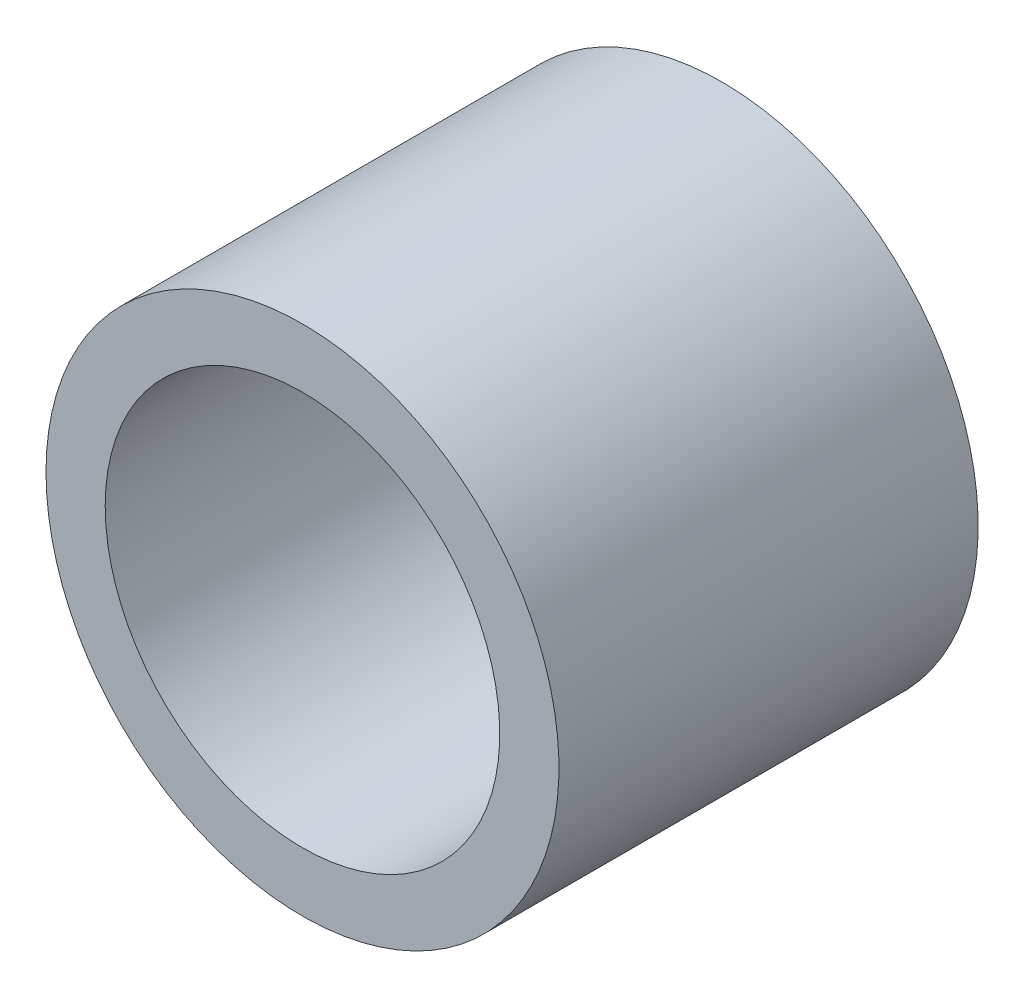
ISO-10303-21;
HEADER;
FILE_DESCRIPTION(('STEP AP214'),'2;1');
FILE_NAME('part.step','',(''),(''),'','','');
FILE_SCHEMA(('AUTOMOTIVE_DESIGN { 1 0 10303 214 1 1 1 1 }'));
ENDSEC;
DATA;
#1=APPLICATION_CONTEXT('core data for automotive mechanical design processes');
#2=APPLICATION_PROTOCOL_DEFINITION('international standard','automotive_design',2000,#1);
#3=PRODUCT_CONTEXT('',#1,'mechanical');
#4=PRODUCT('Part','Part','',(#3));
#5=PRODUCT_RELATED_PRODUCT_CATEGORY('part','',(#4));
#6=PRODUCT_DEFINITION_FORMATION('','',#4);
#7=PRODUCT_DEFINITION_CONTEXT('part definition',#1,'design');
#8=PRODUCT_DEFINITION('design','',#6,#7);
#9=PRODUCT_DEFINITION_SHAPE('','',#8);
#10=(LENGTH_UNIT() NAMED_UNIT(*) SI_UNIT(.MILLI.,.METRE.));
#11=(NAMED_UNIT(*) PLANE_ANGLE_UNIT() SI_UNIT($,.RADIAN.));
#12=(NAMED_UNIT(*) SI_UNIT($,.STERADIAN.) SOLID_ANGLE_UNIT());
#13=UNCERTAINTY_MEASURE_WITH_UNIT(LENGTH_MEASURE(1.E-05),#10,'distance_accuracy_value','');
#14=(GEOMETRIC_REPRESENTATION_CONTEXT(3) GLOBAL_UNCERTAINTY_ASSIGNED_CONTEXT((#13)) GLOBAL_UNIT_ASSIGNED_CONTEXT((#10,
#11,#12)) REPRESENTATION_CONTEXT('',''));
#15=CARTESIAN_POINT('',(0.,0.,0.));
#16=DIRECTION('',(0.,0.,1.));
#17=DIRECTION('',(1.,0.,0.));
#18=AXIS2_PLACEMENT_3D('',#15,#16,#17);
#19=CARTESIAN_POINT('',(0.,0.,21.59));
#20=DIRECTION('',(0.,0.,-1.));
#21=DIRECTION('',(-1.,0.,0.));
#22=AXIS2_PLACEMENT_3D('',#19,#20,#21);
#23=CYLINDRICAL_SURFACE('',#22,10.16);
#24=CARTESIAN_POINT('',(0.,0.,0.));
#25=DIRECTION('',(0.,0.,-1.));
#26=DIRECTION('',(-1.,0.,0.));
#27=AXIS2_PLACEMENT_3D('',#24,#25,#26);
#28=CIRCLE('',#27,10.16);
#29=CARTESIAN_POINT('',(-10.16,0.,0.));
#30=VERTEX_POINT('',#29);
#31=EDGE_CURVE('E24',#30,#30,#28,.T.);
#32=ORIENTED_EDGE('',*,*,#31,.T.);
#33=EDGE_LOOP('',(#32));
#34=FACE_BOUND('',#33,.T.);
#35=CARTESIAN_POINT('',(0.,0.,21.59));
#36=DIRECTION('',(0.,0.,-1.));
#37=DIRECTION('',(-1.,0.,0.));
#38=AXIS2_PLACEMENT_3D('',#35,#36,#37);
#39=CIRCLE('',#38,10.16);
#40=CARTESIAN_POINT('',(-10.16,0.,21.59));
#41=VERTEX_POINT('',#40);
#42=EDGE_CURVE('E15',#41,#41,#39,.T.);
#43=ORIENTED_EDGE('',*,*,#42,.F.);
#44=EDGE_LOOP('',(#43));
#45=FACE_BOUND('',#44,.T.);
#46=ADVANCED_FACE('F12',(#34,#45),#23,.F.);
#47=CARTESIAN_POINT('',(0.,0.,21.59));
#48=DIRECTION('',(0.,0.,1.));
#49=DIRECTION('',(1.,0.,0.));
#50=AXIS2_PLACEMENT_3D('',#47,#48,#49);
#51=PLANE('',#50);
#52=ORIENTED_EDGE('',*,*,#42,.T.);
#53=EDGE_LOOP('',(#52));
#54=FACE_BOUND('',#53,.T.);
#55=CARTESIAN_POINT('',(0.,0.,21.59));
#56=DIRECTION('',(0.,0.,-1.));
#57=DIRECTION('',(-1.,0.,0.));
#58=AXIS2_PLACEMENT_3D('',#55,#56,#57);
#59=CIRCLE('',#58,13.208);
#60=CARTESIAN_POINT('',(-13.208,0.,21.59));
#61=VERTEX_POINT('',#60);
#62=EDGE_CURVE('E19',#61,#61,#59,.T.);
#63=ORIENTED_EDGE('',*,*,#62,.F.);
#64=EDGE_LOOP('',(#63));
#65=FACE_BOUND('',#64,.T.);
#66=ADVANCED_FACE('F32',(#54,#65),#51,.T.);
#67=CARTESIAN_POINT('',(0.,0.,0.));
#68=DIRECTION('',(0.,0.,1.));
#69=DIRECTION('',(1.,0.,0.));
#70=AXIS2_PLACEMENT_3D('',#67,#68,#69);
#71=PLANE('',#70);
#72=ORIENTED_EDGE('',*,*,#31,.F.);
#73=EDGE_LOOP('',(#72));
#74=FACE_BOUND('',#73,.T.);
#75=CARTESIAN_POINT('',(0.,0.,0.));
#76=DIRECTION('',(0.,0.,-1.));
#77=DIRECTION('',(-1.,0.,0.));
#78=AXIS2_PLACEMENT_3D('',#75,#76,#77);
#79=CIRCLE('',#78,13.208);
#80=CARTESIAN_POINT('',(-13.208,0.,0.));
#81=VERTEX_POINT('',#80);
#82=EDGE_CURVE('E8',#81,#81,#79,.F.);
#83=ORIENTED_EDGE('',*,*,#82,.F.);
#84=EDGE_LOOP('',(#83));
#85=FACE_BOUND('',#84,.T.);
#86=ADVANCED_FACE('F37',(#74,#85),#71,.F.);
#87=CARTESIAN_POINT('',(0.,0.,21.59));
#88=DIRECTION('',(0.,0.,-1.));
#89=DIRECTION('',(-1.,0.,0.));
#90=AXIS2_PLACEMENT_3D('',#87,#88,#89);
#91=CYLINDRICAL_SURFACE('',#90,13.208);
#92=ORIENTED_EDGE('',*,*,#82,.T.);
#93=EDGE_LOOP('',(#92));
#94=FACE_BOUND('',#93,.T.);
#95=ORIENTED_EDGE('',*,*,#62,.T.);
#96=EDGE_LOOP('',(#95));
#97=FACE_BOUND('',#96,.T.);
#98=ADVANCED_FACE('F41',(#94,#97),#91,.T.);
#99=CLOSED_SHELL('',(#46,#66,#86,#98));
#100=MANIFOLD_SOLID_BREP('B1',#99);
#101=ADVANCED_BREP_SHAPE_REPRESENTATION('',(#18,#100),#14);
#102=SHAPE_DEFINITION_REPRESENTATION(#9,#101);
ENDSEC;
END-ISO-10303-21;
